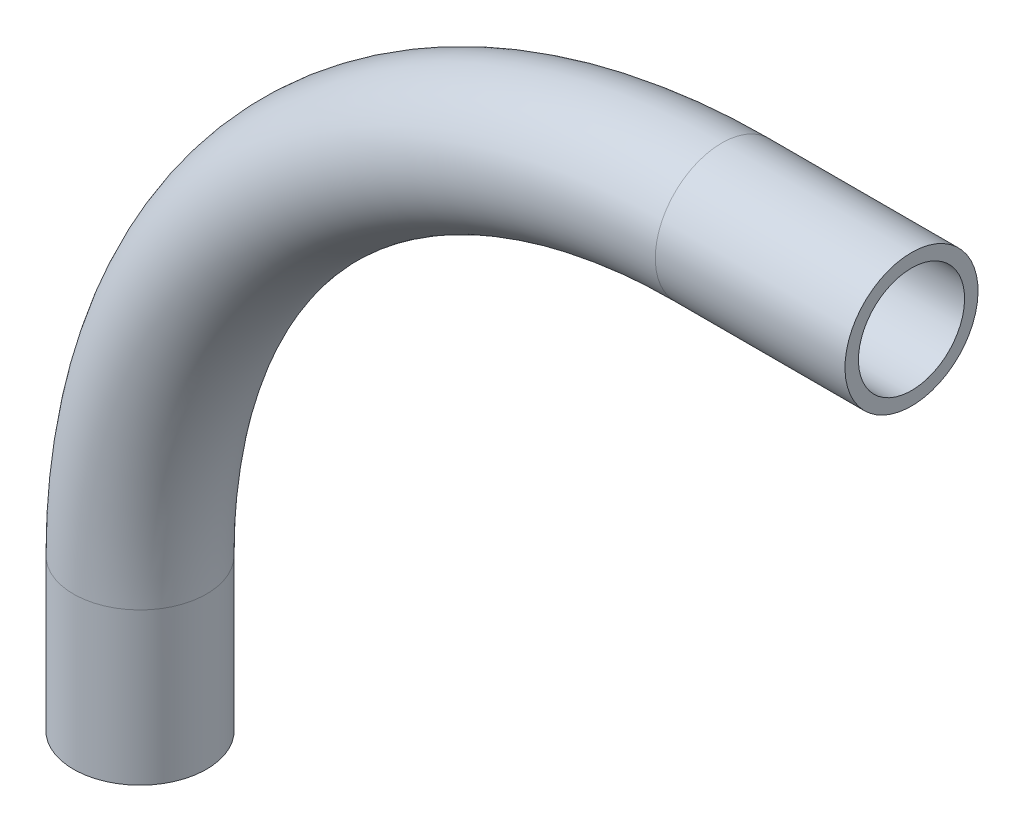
from build123d import *

# Parameters (mm, degrees)
ROUTE_R                       = 16.7005
ELBOWSHELL_T                  = -3.3782
SKETCH2_R                     = 16.7005
SKETCH2_R_2                   = 13.3223
ELBOWEXTENSION_EXTRUDE1_DEPTH = 47.625
SKETCH3_R                     = 16.7005
SKETCH3_R_2                   = 13.3223
ELBOWEXTENSION_EXTRUDE2_DEPTH = 38.1


with BuildPart() as part:
    # Elbow: sweep along a path in ElbowArc
    with BuildLine(Plane.XY) as elbow_path:
        ThreePointArc((-146.05, 0), (-103.272945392, 103.272945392), (0, 146.05))
    # Route → Elbow (sweep)
    with BuildSketch(Plane(origin=(0, 0, 0), x_dir=(1, 0, 0), z_dir=(0, 1, 0))):
        with Locations((-146.05, 0)):
            Circle(ROUTE_R)
    sweep(path=elbow_path.line)

    # ElbowShell
    elbowshell_openings = [part.faces().sort_by_distance(p)[0] for p in [
        (0, 146.05, 0),
        (-146.05, 0, 0),
    ]]
    offset(amount=ELBOWSHELL_T, openings=elbowshell_openings, kind=Kind.INTERSECTION)

    # Sketch2 → ElbowExtension-Extrude1 (add)
    with BuildSketch(Plane(origin=(0, 0, 0), x_dir=(0, 0, -1), z_dir=(1, 0, 0))):
        with Locations(Location((0, 146.05, 0), (0, 0, 90))):
            Circle(SKETCH2_R)
        with Locations(Location((0, 146.05, 0), (0, 0, 90))):
            Circle(SKETCH2_R_2, mode=Mode.SUBTRACT)
    extrude(amount=ELBOWEXTENSION_EXTRUDE1_DEPTH)

    # Sketch3 → ElbowExtension-Extrude2 (add)
    with BuildSketch(Plane.XZ):
        with Locations(Location((-146.05, 0, 0), (0, 0, 180))):
            Circle(SKETCH3_R)
        with Locations(Location((-146.05, 0, 0), (0, 0, 180))):
            Circle(SKETCH3_R_2, mode=Mode.SUBTRACT)
    extrude(amount=ELBOWEXTENSION_EXTRUDE2_DEPTH)


solid = part.part
